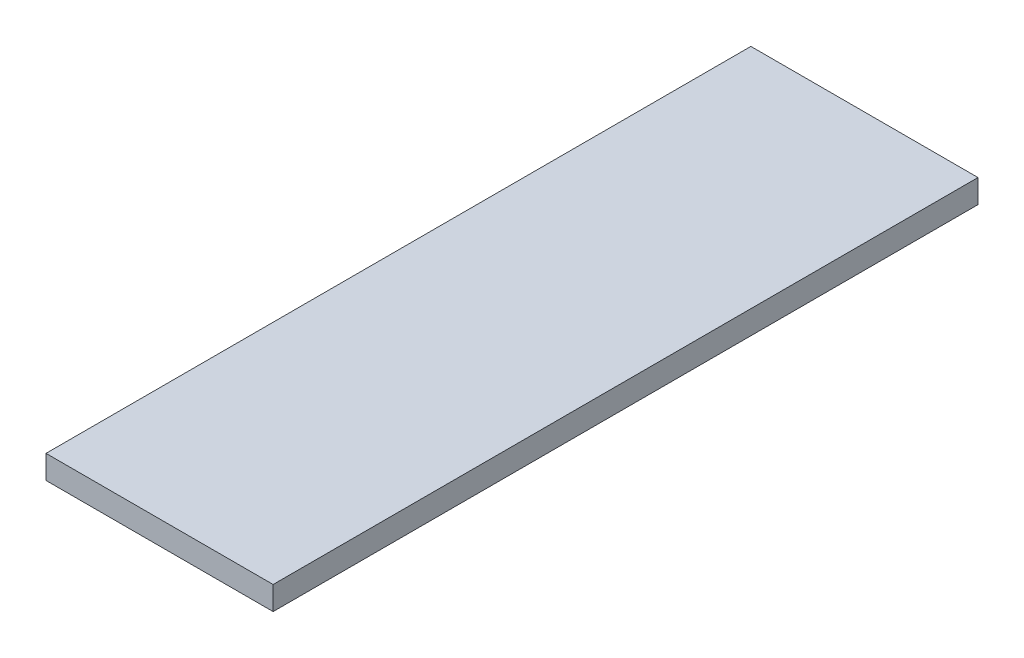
from build123d import *

# Parameters (mm, degrees)
SKETCH1_W           = 46.0375
SKETCH1_H           = 142.875
BOSS_EXTRUDE1_DEPTH = 4.7625


with BuildPart() as part:
    # Sketch1 → Boss-Extrude1 (new body)
    with BuildSketch(Plane(origin=(0, 0, 0), x_dir=(1, 0, 0), z_dir=(0, 1, 0))):
        Rectangle(SKETCH1_W, SKETCH1_H)
    extrude(amount=BOSS_EXTRUDE1_DEPTH)


solid = part.part
